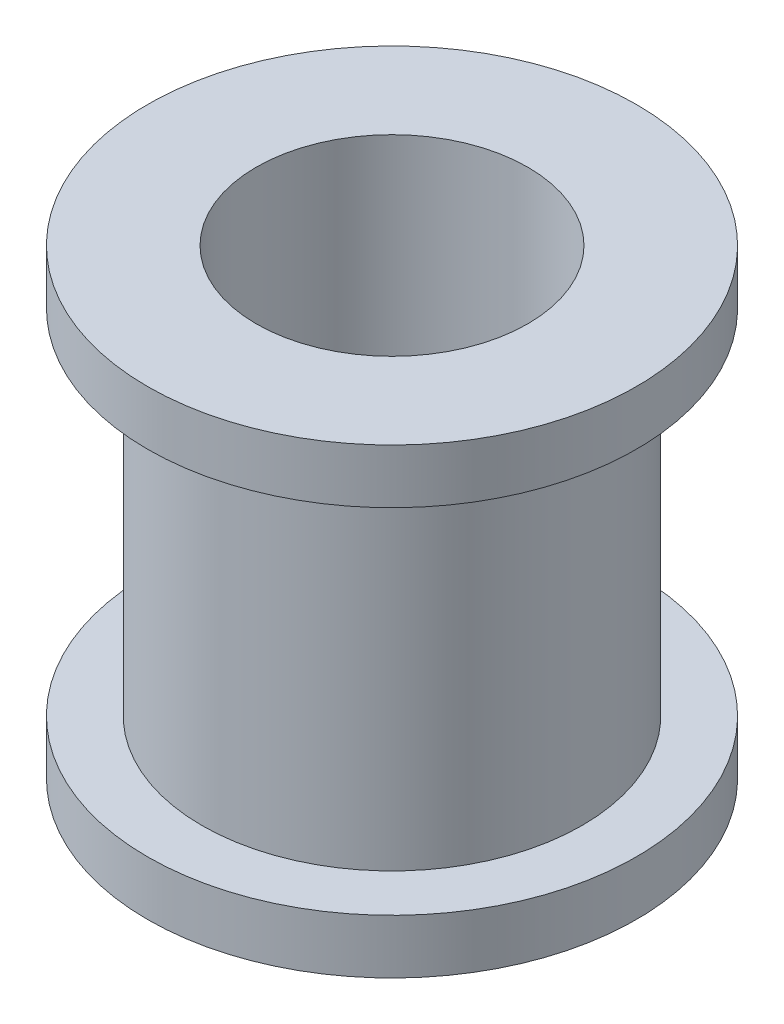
ISO-10303-21;
HEADER;
FILE_DESCRIPTION(('STEP AP214'),'2;1');
FILE_NAME('part.step','',(''),(''),'','','');
FILE_SCHEMA(('AUTOMOTIVE_DESIGN { 1 0 10303 214 1 1 1 1 }'));
ENDSEC;
DATA;
#1=APPLICATION_CONTEXT('core data for automotive mechanical design processes');
#2=APPLICATION_PROTOCOL_DEFINITION('international standard','automotive_design',2000,#1);
#3=PRODUCT_CONTEXT('',#1,'mechanical');
#4=PRODUCT('Part','Part','',(#3));
#5=PRODUCT_RELATED_PRODUCT_CATEGORY('part','',(#4));
#6=PRODUCT_DEFINITION_FORMATION('','',#4);
#7=PRODUCT_DEFINITION_CONTEXT('part definition',#1,'design');
#8=PRODUCT_DEFINITION('design','',#6,#7);
#9=PRODUCT_DEFINITION_SHAPE('','',#8);
#10=(LENGTH_UNIT() NAMED_UNIT(*) SI_UNIT(.MILLI.,.METRE.));
#11=(NAMED_UNIT(*) PLANE_ANGLE_UNIT() SI_UNIT($,.RADIAN.));
#12=(NAMED_UNIT(*) SI_UNIT($,.STERADIAN.) SOLID_ANGLE_UNIT());
#13=UNCERTAINTY_MEASURE_WITH_UNIT(LENGTH_MEASURE(1.E-05),#10,'distance_accuracy_value','');
#14=(GEOMETRIC_REPRESENTATION_CONTEXT(3) GLOBAL_UNCERTAINTY_ASSIGNED_CONTEXT((#13)) GLOBAL_UNIT_ASSIGNED_CONTEXT((#10,
#11,#12)) REPRESENTATION_CONTEXT('',''));
#15=CARTESIAN_POINT('',(0.,0.,0.));
#16=DIRECTION('',(0.,0.,1.));
#17=DIRECTION('',(1.,0.,0.));
#18=AXIS2_PLACEMENT_3D('',#15,#16,#17);
#19=CARTESIAN_POINT('',(-24.,205.,0.));
#20=DIRECTION('',(0.,1.,0.));
#21=DIRECTION('',(0.,0.,1.));
#22=AXIS2_PLACEMENT_3D('',#19,#20,#21);
#23=PLANE('',#22);
#24=CARTESIAN_POINT('',(-29.,205.,0.));
#25=DIRECTION('',(0.,-1.,0.));
#26=DIRECTION('',(0.,0.,-1.));
#27=AXIS2_PLACEMENT_3D('',#24,#25,#26);
#28=CIRCLE('',#27,5.);
#29=CARTESIAN_POINT('',(-29.,205.,-5.));
#30=VERTEX_POINT('',#29);
#31=EDGE_CURVE('E391',#30,#30,#28,.T.);
#32=ORIENTED_EDGE('',*,*,#31,.T.);
#33=EDGE_LOOP('',(#32));
#34=FACE_BOUND('',#33,.T.);
#35=CARTESIAN_POINT('',(-29.,205.,0.));
#36=DIRECTION('',(0.,-1.,0.));
#37=DIRECTION('',(0.,0.,-1.));
#38=AXIS2_PLACEMENT_3D('',#35,#36,#37);
#39=CIRCLE('',#38,9.);
#40=CARTESIAN_POINT('',(-29.,205.,-9.));
#41=VERTEX_POINT('',#40);
#42=EDGE_CURVE('E10',#41,#41,#39,.T.);
#43=ORIENTED_EDGE('',*,*,#42,.F.);
#44=EDGE_LOOP('',(#43));
#45=FACE_BOUND('',#44,.T.);
#46=ADVANCED_FACE('F357',(#34,#45),#23,.T.);
#47=CARTESIAN_POINT('',(-29.,179.,0.));
#48=DIRECTION('',(0.,-1.,0.));
#49=DIRECTION('',(0.,0.,-1.));
#50=AXIS2_PLACEMENT_3D('',#47,#48,#49);
#51=CYLINDRICAL_SURFACE('',#50,9.);
#52=ORIENTED_EDGE('',*,*,#42,.T.);
#53=EDGE_LOOP('',(#52));
#54=FACE_BOUND('',#53,.T.);
#55=CARTESIAN_POINT('',(-29.,203.,0.));
#56=DIRECTION('',(0.,-1.,0.));
#57=DIRECTION('',(0.,0.,-1.));
#58=AXIS2_PLACEMENT_3D('',#55,#56,#57);
#59=CIRCLE('',#58,9.);
#60=CARTESIAN_POINT('',(-29.,203.,-9.));
#61=VERTEX_POINT('',#60);
#62=EDGE_CURVE('E363',#61,#61,#59,.T.);
#63=ORIENTED_EDGE('',*,*,#62,.F.);
#64=EDGE_LOOP('',(#63));
#65=FACE_BOUND('',#64,.T.);
#66=ADVANCED_FACE('F418',(#54,#65),#51,.T.);
#67=CARTESIAN_POINT('',(-20.,203.,0.));
#68=DIRECTION('',(0.,-1.,0.));
#69=DIRECTION('',(0.,0.,-1.));
#70=AXIS2_PLACEMENT_3D('',#67,#68,#69);
#71=PLANE('',#70);
#72=ORIENTED_EDGE('',*,*,#62,.T.);
#73=EDGE_LOOP('',(#72));
#74=FACE_BOUND('',#73,.T.);
#75=CARTESIAN_POINT('',(-29.,203.,0.));
#76=DIRECTION('',(0.,-1.,0.));
#77=DIRECTION('',(0.,0.,-1.));
#78=AXIS2_PLACEMENT_3D('',#75,#76,#77);
#79=CIRCLE('',#78,7.00000000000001);
#80=CARTESIAN_POINT('',(-29.,203.,-7.00000000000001));
#81=VERTEX_POINT('',#80);
#82=EDGE_CURVE('E367',#81,#81,#79,.T.);
#83=ORIENTED_EDGE('',*,*,#82,.F.);
#84=EDGE_LOOP('',(#83));
#85=FACE_BOUND('',#84,.T.);
#86=ADVANCED_FACE('F422',(#74,#85),#71,.T.);
#87=CARTESIAN_POINT('',(-29.,179.,0.));
#88=DIRECTION('',(0.,-1.,0.));
#89=DIRECTION('',(0.,0.,-1.));
#90=AXIS2_PLACEMENT_3D('',#87,#88,#89);
#91=CYLINDRICAL_SURFACE('',#90,7.00000000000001);
#92=ORIENTED_EDGE('',*,*,#82,.T.);
#93=EDGE_LOOP('',(#92));
#94=FACE_BOUND('',#93,.T.);
#95=CARTESIAN_POINT('',(-29.,190.,0.));
#96=DIRECTION('',(0.,-1.,0.));
#97=DIRECTION('',(0.,0.,-1.));
#98=AXIS2_PLACEMENT_3D('',#95,#96,#97);
#99=CIRCLE('',#98,7.00000000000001);
#100=CARTESIAN_POINT('',(-29.,190.,-7.00000000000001));
#101=VERTEX_POINT('',#100);
#102=EDGE_CURVE('E371',#101,#101,#99,.T.);
#103=ORIENTED_EDGE('',*,*,#102,.F.);
#104=EDGE_LOOP('',(#103));
#105=FACE_BOUND('',#104,.T.);
#106=ADVANCED_FACE('F426',(#94,#105),#91,.T.);
#107=CARTESIAN_POINT('',(-22.,190.,0.));
#108=DIRECTION('',(0.,1.,0.));
#109=DIRECTION('',(0.,0.,1.));
#110=AXIS2_PLACEMENT_3D('',#107,#108,#109);
#111=PLANE('',#110);
#112=ORIENTED_EDGE('',*,*,#102,.T.);
#113=EDGE_LOOP('',(#112));
#114=FACE_BOUND('',#113,.T.);
#115=CARTESIAN_POINT('',(-29.,190.,0.));
#116=DIRECTION('',(0.,-1.,0.));
#117=DIRECTION('',(0.,0.,-1.));
#118=AXIS2_PLACEMENT_3D('',#115,#116,#117);
#119=CIRCLE('',#118,9.00000000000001);
#120=CARTESIAN_POINT('',(-29.,190.,-9.00000000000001));
#121=VERTEX_POINT('',#120);
#122=EDGE_CURVE('E376',#121,#121,#119,.T.);
#123=ORIENTED_EDGE('',*,*,#122,.F.);
#124=EDGE_LOOP('',(#123));
#125=FACE_BOUND('',#124,.T.);
#126=ADVANCED_FACE('F432',(#114,#125),#111,.T.);
#127=CARTESIAN_POINT('',(-29.,179.,0.));
#128=DIRECTION('',(0.,-1.,0.));
#129=DIRECTION('',(0.,0.,-1.));
#130=AXIS2_PLACEMENT_3D('',#127,#128,#129);
#131=CYLINDRICAL_SURFACE('',#130,9.00000000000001);
#132=ORIENTED_EDGE('',*,*,#122,.T.);
#133=EDGE_LOOP('',(#132));
#134=FACE_BOUND('',#133,.T.);
#135=CARTESIAN_POINT('',(-29.,188.,0.));
#136=DIRECTION('',(0.,-1.,0.));
#137=DIRECTION('',(0.,0.,-1.));
#138=AXIS2_PLACEMENT_3D('',#135,#136,#137);
#139=CIRCLE('',#138,9.00000000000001);
#140=CARTESIAN_POINT('',(-29.,188.,-9.00000000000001));
#141=VERTEX_POINT('',#140);
#142=EDGE_CURVE('E379',#141,#141,#139,.T.);
#143=ORIENTED_EDGE('',*,*,#142,.F.);
#144=EDGE_LOOP('',(#143));
#145=FACE_BOUND('',#144,.T.);
#146=ADVANCED_FACE('F436',(#134,#145),#131,.T.);
#147=CARTESIAN_POINT('',(-20.,188.,0.));
#148=DIRECTION('',(0.,-1.,0.));
#149=DIRECTION('',(0.,0.,-1.));
#150=AXIS2_PLACEMENT_3D('',#147,#148,#149);
#151=PLANE('',#150);
#152=ORIENTED_EDGE('',*,*,#142,.T.);
#153=EDGE_LOOP('',(#152));
#154=FACE_BOUND('',#153,.T.);
#155=CARTESIAN_POINT('',(-29.,188.,0.));
#156=DIRECTION('',(0.,-1.,0.));
#157=DIRECTION('',(0.,0.,-1.));
#158=AXIS2_PLACEMENT_3D('',#155,#156,#157);
#159=CIRCLE('',#158,6.25);
#160=CARTESIAN_POINT('',(-29.,188.,-6.25));
#161=VERTEX_POINT('',#160);
#162=EDGE_CURVE('E382',#161,#161,#159,.T.);
#163=ORIENTED_EDGE('',*,*,#162,.F.);
#164=EDGE_LOOP('',(#163));
#165=FACE_BOUND('',#164,.T.);
#166=ADVANCED_FACE('F440',(#154,#165),#151,.T.);
#167=CARTESIAN_POINT('',(-29.,179.,0.));
#168=DIRECTION('',(0.,-1.,0.));
#169=DIRECTION('',(0.,0.,-1.));
#170=AXIS2_PLACEMENT_3D('',#167,#168,#169);
#171=CYLINDRICAL_SURFACE('',#170,6.25);
#172=ORIENTED_EDGE('',*,*,#162,.T.);
#173=EDGE_LOOP('',(#172));
#174=FACE_BOUND('',#173,.T.);
#175=CARTESIAN_POINT('',(-29.,189.5,0.));
#176=DIRECTION('',(0.,-1.,0.));
#177=DIRECTION('',(0.,0.,-1.));
#178=AXIS2_PLACEMENT_3D('',#175,#176,#177);
#179=CIRCLE('',#178,6.25);
#180=CARTESIAN_POINT('',(-29.,189.5,-6.25));
#181=VERTEX_POINT('',#180);
#182=EDGE_CURVE('E385',#181,#181,#179,.T.);
#183=ORIENTED_EDGE('',*,*,#182,.F.);
#184=EDGE_LOOP('',(#183));
#185=FACE_BOUND('',#184,.T.);
#186=ADVANCED_FACE('F444',(#174,#185),#171,.F.);
#187=CARTESIAN_POINT('',(-22.75,189.5,0.));
#188=DIRECTION('',(0.,-1.,0.));
#189=DIRECTION('',(0.,0.,-1.));
#190=AXIS2_PLACEMENT_3D('',#187,#188,#189);
#191=PLANE('',#190);
#192=CARTESIAN_POINT('',(-29.,189.5,0.));
#193=DIRECTION('',(0.,-1.,0.));
#194=DIRECTION('',(0.,0.,-1.));
#195=AXIS2_PLACEMENT_3D('',#192,#193,#194);
#196=CIRCLE('',#195,2.49999999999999);
#197=CARTESIAN_POINT('',(-29.,189.5,-2.49999999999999));
#198=VERTEX_POINT('',#197);
#199=EDGE_CURVE('E394',#198,#198,#196,.T.);
#200=ORIENTED_EDGE('',*,*,#199,.F.);
#201=EDGE_LOOP('',(#200));
#202=FACE_BOUND('',#201,.T.);
#203=ORIENTED_EDGE('',*,*,#182,.T.);
#204=EDGE_LOOP('',(#203));
#205=FACE_BOUND('',#204,.T.);
#206=ADVANCED_FACE('F407',(#202,#205),#191,.T.);
#207=CARTESIAN_POINT('',(-29.,195.5,0.));
#208=DIRECTION('',(0.,1.,0.));
#209=DIRECTION('',(0.,0.,1.));
#210=AXIS2_PLACEMENT_3D('',#207,#208,#209);
#211=PLANE('',#210);
#212=CARTESIAN_POINT('',(-29.,195.5,0.));
#213=DIRECTION('',(0.,1.,0.));
#214=DIRECTION('',(0.,0.,1.));
#215=AXIS2_PLACEMENT_3D('',#212,#213,#214);
#216=CIRCLE('',#215,2.49999999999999);
#217=CARTESIAN_POINT('',(-29.,195.5,2.49999999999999));
#218=VERTEX_POINT('',#217);
#219=EDGE_CURVE('E397',#218,#218,#216,.T.);
#220=ORIENTED_EDGE('',*,*,#219,.F.);
#221=EDGE_LOOP('',(#220));
#222=FACE_BOUND('',#221,.T.);
#223=CARTESIAN_POINT('',(-29.,195.5,0.));
#224=DIRECTION('',(0.,-1.,0.));
#225=DIRECTION('',(0.,0.,-1.));
#226=AXIS2_PLACEMENT_3D('',#223,#224,#225);
#227=CIRCLE('',#226,5.);
#228=CARTESIAN_POINT('',(-29.,195.5,-5.));
#229=VERTEX_POINT('',#228);
#230=EDGE_CURVE('E388',#229,#229,#227,.T.);
#231=ORIENTED_EDGE('',*,*,#230,.F.);
#232=EDGE_LOOP('',(#231));
#233=FACE_BOUND('',#232,.T.);
#234=ADVANCED_FACE('F403',(#222,#233),#211,.T.);
#235=CARTESIAN_POINT('',(-29.,179.,0.));
#236=DIRECTION('',(0.,-1.,0.));
#237=DIRECTION('',(0.,0.,-1.));
#238=AXIS2_PLACEMENT_3D('',#235,#236,#237);
#239=CYLINDRICAL_SURFACE('',#238,5.);
#240=ORIENTED_EDGE('',*,*,#230,.T.);
#241=EDGE_LOOP('',(#240));
#242=FACE_BOUND('',#241,.T.);
#243=ORIENTED_EDGE('',*,*,#31,.F.);
#244=EDGE_LOOP('',(#243));
#245=FACE_BOUND('',#244,.T.);
#246=ADVANCED_FACE('F406',(#242,#245),#239,.F.);
#247=CARTESIAN_POINT('',(-29.,195.5,0.));
#248=DIRECTION('',(0.,1.,0.));
#249=DIRECTION('',(0.,0.,1.));
#250=AXIS2_PLACEMENT_3D('',#247,#248,#249);
#251=CYLINDRICAL_SURFACE('',#250,2.49999999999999);
#252=ORIENTED_EDGE('',*,*,#199,.T.);
#253=EDGE_LOOP('',(#252));
#254=FACE_BOUND('',#253,.T.);
#255=ORIENTED_EDGE('',*,*,#219,.T.);
#256=EDGE_LOOP('',(#255));
#257=FACE_BOUND('',#256,.T.);
#258=ADVANCED_FACE('F401',(#254,#257),#251,.F.);
#259=CLOSED_SHELL('',(#46,#66,#86,#106,#126,#146,#166,#186,#206,#234,#246,#258));
#260=MANIFOLD_SOLID_BREP('B2',#259);
#261=ADVANCED_BREP_SHAPE_REPRESENTATION('',(#18,#260),#14);
#262=SHAPE_DEFINITION_REPRESENTATION(#9,#261);
ENDSEC;
END-ISO-10303-21;
